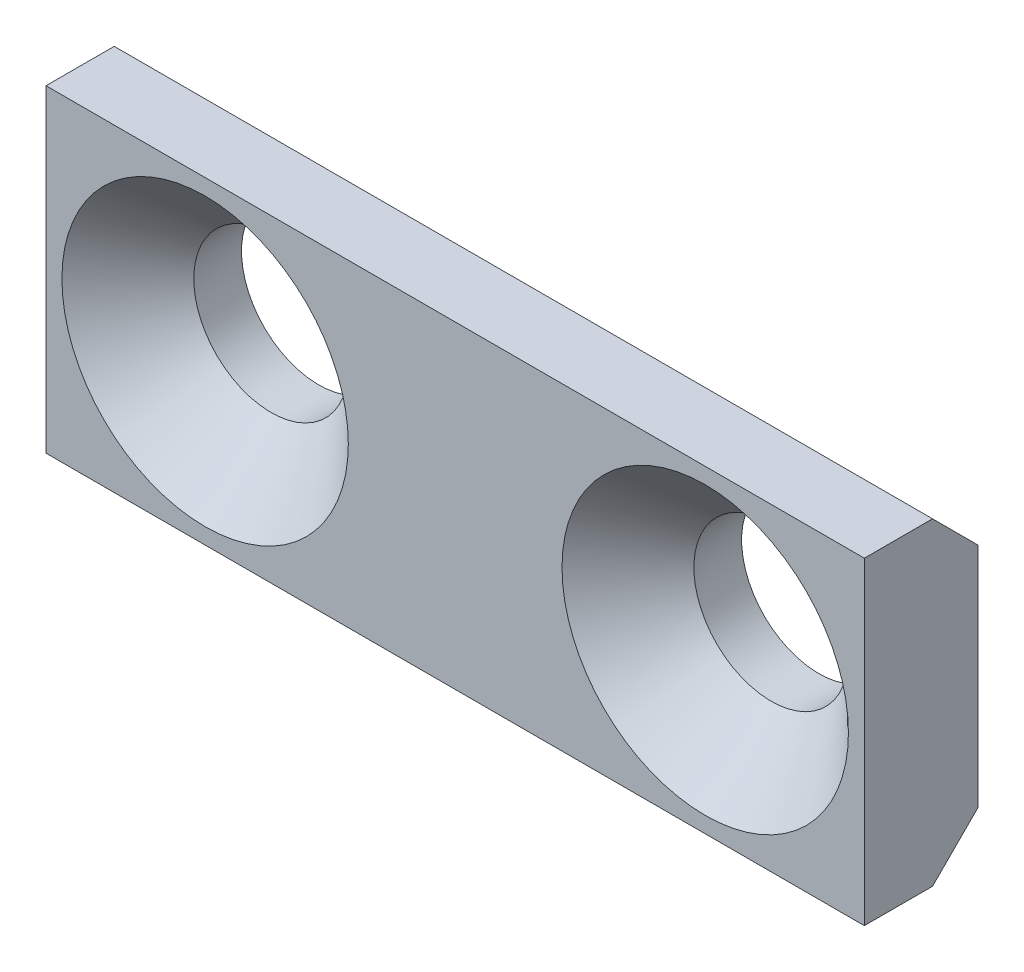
ISO-10303-21;
HEADER;
FILE_DESCRIPTION(('STEP AP214'),'2;1');
FILE_NAME('part.step','',(''),(''),'','','');
FILE_SCHEMA(('AUTOMOTIVE_DESIGN { 1 0 10303 214 1 1 1 1 }'));
ENDSEC;
DATA;
#1=APPLICATION_CONTEXT('core data for automotive mechanical design processes');
#2=APPLICATION_PROTOCOL_DEFINITION('international standard','automotive_design',2000,#1);
#3=PRODUCT_CONTEXT('',#1,'mechanical');
#4=PRODUCT('Part','Part','',(#3));
#5=PRODUCT_RELATED_PRODUCT_CATEGORY('part','',(#4));
#6=PRODUCT_DEFINITION_FORMATION('','',#4);
#7=PRODUCT_DEFINITION_CONTEXT('part definition',#1,'design');
#8=PRODUCT_DEFINITION('design','',#6,#7);
#9=PRODUCT_DEFINITION_SHAPE('','',#8);
#10=(LENGTH_UNIT() NAMED_UNIT(*) SI_UNIT(.MILLI.,.METRE.));
#11=(NAMED_UNIT(*) PLANE_ANGLE_UNIT() SI_UNIT($,.RADIAN.));
#12=(NAMED_UNIT(*) SI_UNIT($,.STERADIAN.) SOLID_ANGLE_UNIT());
#13=UNCERTAINTY_MEASURE_WITH_UNIT(LENGTH_MEASURE(1.E-05),#10,'distance_accuracy_value','');
#14=(GEOMETRIC_REPRESENTATION_CONTEXT(3) GLOBAL_UNCERTAINTY_ASSIGNED_CONTEXT((#13)) GLOBAL_UNIT_ASSIGNED_CONTEXT((#10,
#11,#12)) REPRESENTATION_CONTEXT('',''));
#15=CARTESIAN_POINT('',(0.,0.,0.));
#16=DIRECTION('',(0.,0.,1.));
#17=DIRECTION('',(1.,0.,0.));
#18=AXIS2_PLACEMENT_3D('',#15,#16,#17);
#19=CARTESIAN_POINT('',(-8.99999999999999,3.5,2.5));
#20=DIRECTION('',(1.,0.,0.));
#21=DIRECTION('',(0.,1.,0.));
#22=AXIS2_PLACEMENT_3D('',#19,#20,#21);
#23=PLANE('',#22);
#24=DIRECTION('',(0.,0.,-1.));
#25=VECTOR('',#24,1.);
#26=CARTESIAN_POINT('',(-8.99999999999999,3.5,2.5));
#27=LINE('',#26,#25);
#28=CARTESIAN_POINT('',(-8.99999999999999,3.5,2.5));
#29=VERTEX_POINT('',#28);
#30=CARTESIAN_POINT('',(-8.99999999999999,3.5,1.));
#31=VERTEX_POINT('',#30);
#32=EDGE_CURVE('E129',#29,#31,#27,.T.);
#33=ORIENTED_EDGE('',*,*,#32,.T.);
#34=DIRECTION('',(0.,0.707106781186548,0.707106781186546));
#35=VECTOR('',#34,1.);
#36=CARTESIAN_POINT('',(-8.99999999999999,3.5,1.));
#37=LINE('',#36,#35);
#38=CARTESIAN_POINT('',(-8.99999999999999,2.5,0.));
#39=VERTEX_POINT('',#38);
#40=EDGE_CURVE('E115',#31,#39,#37,.F.);
#41=ORIENTED_EDGE('',*,*,#40,.T.);
#42=DIRECTION('',(0.,-1.,0.));
#43=VECTOR('',#42,1.);
#44=CARTESIAN_POINT('',(-8.99999999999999,3.5,0.));
#45=LINE('',#44,#43);
#46=CARTESIAN_POINT('',(-8.99999999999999,-2.5,0.));
#47=VERTEX_POINT('',#46);
#48=EDGE_CURVE('E131',#39,#47,#45,.T.);
#49=ORIENTED_EDGE('',*,*,#48,.T.);
#50=DIRECTION('',(0.,0.707106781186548,-0.707106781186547));
#51=VECTOR('',#50,1.);
#52=CARTESIAN_POINT('',(-8.99999999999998,-3.5,1.));
#53=LINE('',#52,#51);
#54=CARTESIAN_POINT('',(-8.99999999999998,-3.5,1.));
#55=VERTEX_POINT('',#54);
#56=EDGE_CURVE('E105',#47,#55,#53,.F.);
#57=ORIENTED_EDGE('',*,*,#56,.T.);
#58=DIRECTION('',(0.,0.,-1.));
#59=VECTOR('',#58,1.);
#60=CARTESIAN_POINT('',(-8.99999999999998,-3.5,2.5));
#61=LINE('',#60,#59);
#62=CARTESIAN_POINT('',(-8.99999999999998,-3.5,2.5));
#63=VERTEX_POINT('',#62);
#64=EDGE_CURVE('E86',#63,#55,#61,.T.);
#65=ORIENTED_EDGE('',*,*,#64,.F.);
#66=DIRECTION('',(0.,-1.,0.));
#67=VECTOR('',#66,1.);
#68=CARTESIAN_POINT('',(-8.99999999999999,3.5,2.5));
#69=LINE('',#68,#67);
#70=EDGE_CURVE('E92',#29,#63,#69,.T.);
#71=ORIENTED_EDGE('',*,*,#70,.F.);
#72=EDGE_LOOP('',(#33,#41,#49,#57,#65,#71));
#73=FACE_BOUND('',#72,.T.);
#74=ADVANCED_FACE('F28',(#73),#23,.F.);
#75=CARTESIAN_POINT('',(-8.99999999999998,-3.5,2.5));
#76=DIRECTION('',(0.,1.,0.));
#77=DIRECTION('',(-1.,0.,0.));
#78=AXIS2_PLACEMENT_3D('',#75,#76,#77);
#79=PLANE('',#78);
#80=ORIENTED_EDGE('',*,*,#64,.T.);
#81=DIRECTION('',(1.,0.,0.));
#82=VECTOR('',#81,1.);
#83=CARTESIAN_POINT('',(-8.99999999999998,-3.5,1.));
#84=LINE('',#83,#82);
#85=CARTESIAN_POINT('',(9.,-3.5,1.));
#86=VERTEX_POINT('',#85);
#87=EDGE_CURVE('E11',#55,#86,#84,.T.);
#88=ORIENTED_EDGE('',*,*,#87,.T.);
#89=DIRECTION('',(0.,0.,-1.));
#90=VECTOR('',#89,1.);
#91=CARTESIAN_POINT('',(9.,-3.5,2.5));
#92=LINE('',#91,#90);
#93=CARTESIAN_POINT('',(9.,-3.5,2.5));
#94=VERTEX_POINT('',#93);
#95=EDGE_CURVE('E88',#94,#86,#92,.T.);
#96=ORIENTED_EDGE('',*,*,#95,.F.);
#97=DIRECTION('',(1.,0.,0.));
#98=VECTOR('',#97,1.);
#99=CARTESIAN_POINT('',(-8.99999999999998,-3.5,2.5));
#100=LINE('',#99,#98);
#101=EDGE_CURVE('E82',#63,#94,#100,.T.);
#102=ORIENTED_EDGE('',*,*,#101,.F.);
#103=EDGE_LOOP('',(#80,#88,#96,#102));
#104=FACE_BOUND('',#103,.T.);
#105=ADVANCED_FACE('F84',(#104),#79,.F.);
#106=CARTESIAN_POINT('',(9.,3.5,2.5));
#107=DIRECTION('',(-1.,0.,0.));
#108=DIRECTION('',(0.,0.,1.));
#109=AXIS2_PLACEMENT_3D('',#106,#107,#108);
#110=PLANE('',#109);
#111=DIRECTION('',(0.,1.,0.));
#112=VECTOR('',#111,1.);
#113=CARTESIAN_POINT('',(9.,3.5,0.));
#114=LINE('',#113,#112);
#115=CARTESIAN_POINT('',(9.,-2.5,0.));
#116=VERTEX_POINT('',#115);
#117=CARTESIAN_POINT('',(9.,2.49999999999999,0.));
#118=VERTEX_POINT('',#117);
#119=EDGE_CURVE('E101',#116,#118,#114,.T.);
#120=ORIENTED_EDGE('',*,*,#119,.T.);
#121=DIRECTION('',(0.,-0.707106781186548,-0.707106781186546));
#122=VECTOR('',#121,1.);
#123=CARTESIAN_POINT('',(9.,3.5,1.));
#124=LINE('',#123,#122);
#125=CARTESIAN_POINT('',(9.,3.5,1.));
#126=VERTEX_POINT('',#125);
#127=EDGE_CURVE('E35',#118,#126,#124,.F.);
#128=ORIENTED_EDGE('',*,*,#127,.T.);
#129=DIRECTION('',(0.,0.,-1.));
#130=VECTOR('',#129,1.);
#131=CARTESIAN_POINT('',(9.,3.5,2.5));
#132=LINE('',#131,#130);
#133=CARTESIAN_POINT('',(9.,3.5,2.5));
#134=VERTEX_POINT('',#133);
#135=EDGE_CURVE('E110',#134,#126,#132,.T.);
#136=ORIENTED_EDGE('',*,*,#135,.F.);
#137=DIRECTION('',(0.,1.,0.));
#138=VECTOR('',#137,1.);
#139=CARTESIAN_POINT('',(9.,3.5,2.5));
#140=LINE('',#139,#138);
#141=EDGE_CURVE('E91',#94,#134,#140,.T.);
#142=ORIENTED_EDGE('',*,*,#141,.F.);
#143=ORIENTED_EDGE('',*,*,#95,.T.);
#144=DIRECTION('',(0.,-0.707106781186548,0.707106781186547));
#145=VECTOR('',#144,1.);
#146=CARTESIAN_POINT('',(9.,-3.5,1.));
#147=LINE('',#146,#145);
#148=EDGE_CURVE('E42',#86,#116,#147,.F.);
#149=ORIENTED_EDGE('',*,*,#148,.T.);
#150=EDGE_LOOP('',(#120,#128,#136,#142,#143,#149));
#151=FACE_BOUND('',#150,.T.);
#152=ADVANCED_FACE('F124',(#151),#110,.F.);
#153=CARTESIAN_POINT('',(-8.99999999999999,3.5,2.5));
#154=DIRECTION('',(0.,-1.,0.));
#155=DIRECTION('',(0.,0.,-1.));
#156=AXIS2_PLACEMENT_3D('',#153,#154,#155);
#157=PLANE('',#156);
#158=ORIENTED_EDGE('',*,*,#135,.T.);
#159=DIRECTION('',(-1.,0.,0.));
#160=VECTOR('',#159,1.);
#161=CARTESIAN_POINT('',(-8.99999999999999,3.5,1.));
#162=LINE('',#161,#160);
#163=EDGE_CURVE('E106',#126,#31,#162,.T.);
#164=ORIENTED_EDGE('',*,*,#163,.T.);
#165=ORIENTED_EDGE('',*,*,#32,.F.);
#166=DIRECTION('',(-1.,0.,0.));
#167=VECTOR('',#166,1.);
#168=CARTESIAN_POINT('',(-8.99999999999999,3.5,2.5));
#169=LINE('',#168,#167);
#170=EDGE_CURVE('E97',#134,#29,#169,.T.);
#171=ORIENTED_EDGE('',*,*,#170,.F.);
#172=EDGE_LOOP('',(#158,#164,#165,#171));
#173=FACE_BOUND('',#172,.T.);
#174=ADVANCED_FACE('F128',(#173),#157,.F.);
#175=CARTESIAN_POINT('',(-8.99999999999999,3.5,2.5));
#176=DIRECTION('',(0.,0.,1.));
#177=DIRECTION('',(1.,0.,0.));
#178=AXIS2_PLACEMENT_3D('',#175,#176,#177);
#179=PLANE('',#178);
#180=CARTESIAN_POINT('',(-5.49999999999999,0.,2.5));
#181=DIRECTION('',(0.,0.,1.));
#182=DIRECTION('',(1.,0.,0.));
#183=AXIS2_PLACEMENT_3D('',#180,#181,#182);
#184=CIRCLE('',#183,3.15);
#185=CARTESIAN_POINT('',(-2.35,0.,2.5));
#186=VERTEX_POINT('',#185);
#187=EDGE_CURVE('E191',#186,#186,#184,.T.);
#188=ORIENTED_EDGE('',*,*,#187,.F.);
#189=EDGE_LOOP('',(#188));
#190=FACE_BOUND('',#189,.T.);
#191=CARTESIAN_POINT('',(5.5,0.,2.5));
#192=DIRECTION('',(0.,0.,1.));
#193=DIRECTION('',(1.,0.,0.));
#194=AXIS2_PLACEMENT_3D('',#191,#192,#193);
#195=CIRCLE('',#194,3.15);
#196=CARTESIAN_POINT('',(8.65,0.,2.5));
#197=VERTEX_POINT('',#196);
#198=EDGE_CURVE('E133',#197,#197,#195,.T.);
#199=ORIENTED_EDGE('',*,*,#198,.F.);
#200=EDGE_LOOP('',(#199));
#201=FACE_BOUND('',#200,.T.);
#202=ORIENTED_EDGE('',*,*,#70,.T.);
#203=ORIENTED_EDGE('',*,*,#101,.T.);
#204=ORIENTED_EDGE('',*,*,#141,.T.);
#205=ORIENTED_EDGE('',*,*,#170,.T.);
#206=EDGE_LOOP('',(#202,#203,#204,#205));
#207=FACE_BOUND('',#206,.T.);
#208=ADVANCED_FACE('F95',(#190,#201,#207),#179,.T.);
#209=CARTESIAN_POINT('',(-8.99999999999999,3.5,0.));
#210=DIRECTION('',(0.,0.,1.));
#211=DIRECTION('',(1.,0.,0.));
#212=AXIS2_PLACEMENT_3D('',#209,#210,#211);
#213=PLANE('',#212);
#214=CARTESIAN_POINT('',(-5.49999999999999,0.,0.));
#215=DIRECTION('',(0.,0.,1.));
#216=DIRECTION('',(1.,0.,0.));
#217=AXIS2_PLACEMENT_3D('',#214,#215,#216);
#218=CIRCLE('',#217,1.7);
#219=CARTESIAN_POINT('',(-3.8,0.,0.));
#220=VERTEX_POINT('',#219);
#221=EDGE_CURVE('E187',#220,#220,#218,.T.);
#222=ORIENTED_EDGE('',*,*,#221,.T.);
#223=EDGE_LOOP('',(#222));
#224=FACE_BOUND('',#223,.T.);
#225=CARTESIAN_POINT('',(5.5,0.,0.));
#226=DIRECTION('',(0.,0.,1.));
#227=DIRECTION('',(1.,0.,0.));
#228=AXIS2_PLACEMENT_3D('',#225,#226,#227);
#229=CIRCLE('',#228,1.7);
#230=CARTESIAN_POINT('',(7.2,0.,0.));
#231=VERTEX_POINT('',#230);
#232=EDGE_CURVE('E194',#231,#231,#229,.T.);
#233=ORIENTED_EDGE('',*,*,#232,.T.);
#234=EDGE_LOOP('',(#233));
#235=FACE_BOUND('',#234,.T.);
#236=ORIENTED_EDGE('',*,*,#48,.F.);
#237=DIRECTION('',(1.,0.,0.));
#238=VECTOR('',#237,1.);
#239=CARTESIAN_POINT('',(-8.99999999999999,2.5,0.));
#240=LINE('',#239,#238);
#241=EDGE_CURVE('E49',#39,#118,#240,.T.);
#242=ORIENTED_EDGE('',*,*,#241,.T.);
#243=ORIENTED_EDGE('',*,*,#119,.F.);
#244=DIRECTION('',(-1.,0.,0.));
#245=VECTOR('',#244,1.);
#246=CARTESIAN_POINT('',(-8.99999999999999,-2.5,0.));
#247=LINE('',#246,#245);
#248=EDGE_CURVE('E117',#116,#47,#247,.T.);
#249=ORIENTED_EDGE('',*,*,#248,.T.);
#250=EDGE_LOOP('',(#236,#242,#243,#249));
#251=FACE_BOUND('',#250,.T.);
#252=ADVANCED_FACE('F132',(#224,#235,#251),#213,.F.);
#253=CARTESIAN_POINT('',(5.5,0.,2.5));
#254=DIRECTION('',(0.,0.,1.));
#255=DIRECTION('',(1.,0.,0.));
#256=AXIS2_PLACEMENT_3D('',#253,#254,#255);
#257=CONICAL_SURFACE('',#256,3.15,0.785398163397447);
#258=CARTESIAN_POINT('',(5.5,0.,1.05));
#259=DIRECTION('',(0.,0.,1.));
#260=DIRECTION('',(1.,0.,0.));
#261=AXIS2_PLACEMENT_3D('',#258,#259,#260);
#262=CIRCLE('',#261,1.7);
#263=CARTESIAN_POINT('',(7.2,0.,1.05));
#264=VERTEX_POINT('',#263);
#265=EDGE_CURVE('E137',#264,#264,#262,.T.);
#266=ORIENTED_EDGE('',*,*,#265,.F.);
#267=EDGE_LOOP('',(#266));
#268=FACE_BOUND('',#267,.T.);
#269=ORIENTED_EDGE('',*,*,#198,.T.);
#270=EDGE_LOOP('',(#269));
#271=FACE_BOUND('',#270,.T.);
#272=ADVANCED_FACE('F167',(#268,#271),#257,.F.);
#273=CARTESIAN_POINT('',(5.5,0.,2.5));
#274=DIRECTION('',(0.,0.,1.));
#275=DIRECTION('',(1.,0.,0.));
#276=AXIS2_PLACEMENT_3D('',#273,#274,#275);
#277=CYLINDRICAL_SURFACE('',#276,1.7);
#278=ORIENTED_EDGE('',*,*,#232,.F.);
#279=EDGE_LOOP('',(#278));
#280=FACE_BOUND('',#279,.T.);
#281=ORIENTED_EDGE('',*,*,#265,.T.);
#282=EDGE_LOOP('',(#281));
#283=FACE_BOUND('',#282,.T.);
#284=ADVANCED_FACE('F171',(#280,#283),#277,.F.);
#285=CARTESIAN_POINT('',(-5.49999999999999,0.,2.5));
#286=DIRECTION('',(0.,0.,1.));
#287=DIRECTION('',(1.,0.,0.));
#288=AXIS2_PLACEMENT_3D('',#285,#286,#287);
#289=CONICAL_SURFACE('',#288,3.15,0.785398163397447);
#290=CARTESIAN_POINT('',(-5.49999999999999,0.,1.05));
#291=DIRECTION('',(0.,0.,1.));
#292=DIRECTION('',(1.,0.,0.));
#293=AXIS2_PLACEMENT_3D('',#290,#291,#292);
#294=CIRCLE('',#293,1.7);
#295=CARTESIAN_POINT('',(-3.8,0.,1.05));
#296=VERTEX_POINT('',#295);
#297=EDGE_CURVE('E190',#296,#296,#294,.T.);
#298=ORIENTED_EDGE('',*,*,#297,.F.);
#299=EDGE_LOOP('',(#298));
#300=FACE_BOUND('',#299,.T.);
#301=ORIENTED_EDGE('',*,*,#187,.T.);
#302=EDGE_LOOP('',(#301));
#303=FACE_BOUND('',#302,.T.);
#304=ADVANCED_FACE('F175',(#300,#303),#289,.F.);
#305=CARTESIAN_POINT('',(-5.49999999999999,0.,2.5));
#306=DIRECTION('',(0.,0.,1.));
#307=DIRECTION('',(1.,0.,0.));
#308=AXIS2_PLACEMENT_3D('',#305,#306,#307);
#309=CYLINDRICAL_SURFACE('',#308,1.7);
#310=ORIENTED_EDGE('',*,*,#221,.F.);
#311=EDGE_LOOP('',(#310));
#312=FACE_BOUND('',#311,.T.);
#313=ORIENTED_EDGE('',*,*,#297,.T.);
#314=EDGE_LOOP('',(#313));
#315=FACE_BOUND('',#314,.T.);
#316=ADVANCED_FACE('F149',(#312,#315),#309,.F.);
#317=CARTESIAN_POINT('',(-8.99999999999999,3.5,1.));
#318=DIRECTION('',(0.,-0.707106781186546,0.707106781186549));
#319=DIRECTION('',(0.,-0.707106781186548,-0.707106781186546));
#320=AXIS2_PLACEMENT_3D('',#317,#318,#319);
#321=PLANE('',#320);
#322=ORIENTED_EDGE('',*,*,#127,.F.);
#323=ORIENTED_EDGE('',*,*,#241,.F.);
#324=ORIENTED_EDGE('',*,*,#40,.F.);
#325=ORIENTED_EDGE('',*,*,#163,.F.);
#326=EDGE_LOOP('',(#322,#323,#324,#325));
#327=FACE_BOUND('',#326,.T.);
#328=ADVANCED_FACE('F130',(#327),#321,.F.);
#329=CARTESIAN_POINT('',(-8.99999999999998,-3.5,1.));
#330=DIRECTION('',(0.,0.707106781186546,0.707106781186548));
#331=DIRECTION('',(0.,-0.707106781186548,0.707106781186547));
#332=AXIS2_PLACEMENT_3D('',#329,#330,#331);
#333=PLANE('',#332);
#334=ORIENTED_EDGE('',*,*,#56,.F.);
#335=ORIENTED_EDGE('',*,*,#248,.F.);
#336=ORIENTED_EDGE('',*,*,#148,.F.);
#337=ORIENTED_EDGE('',*,*,#87,.F.);
#338=EDGE_LOOP('',(#334,#335,#336,#337));
#339=FACE_BOUND('',#338,.T.);
#340=ADVANCED_FACE('F143',(#339),#333,.F.);
#341=CLOSED_SHELL('',(#74,#105,#152,#174,#208,#252,#272,#284,#304,#316,#328,#340));
#342=MANIFOLD_SOLID_BREP('B2',#341);
#343=ADVANCED_BREP_SHAPE_REPRESENTATION('',(#18,#342),#14);
#344=SHAPE_DEFINITION_REPRESENTATION(#9,#343);
ENDSEC;
END-ISO-10303-21;
